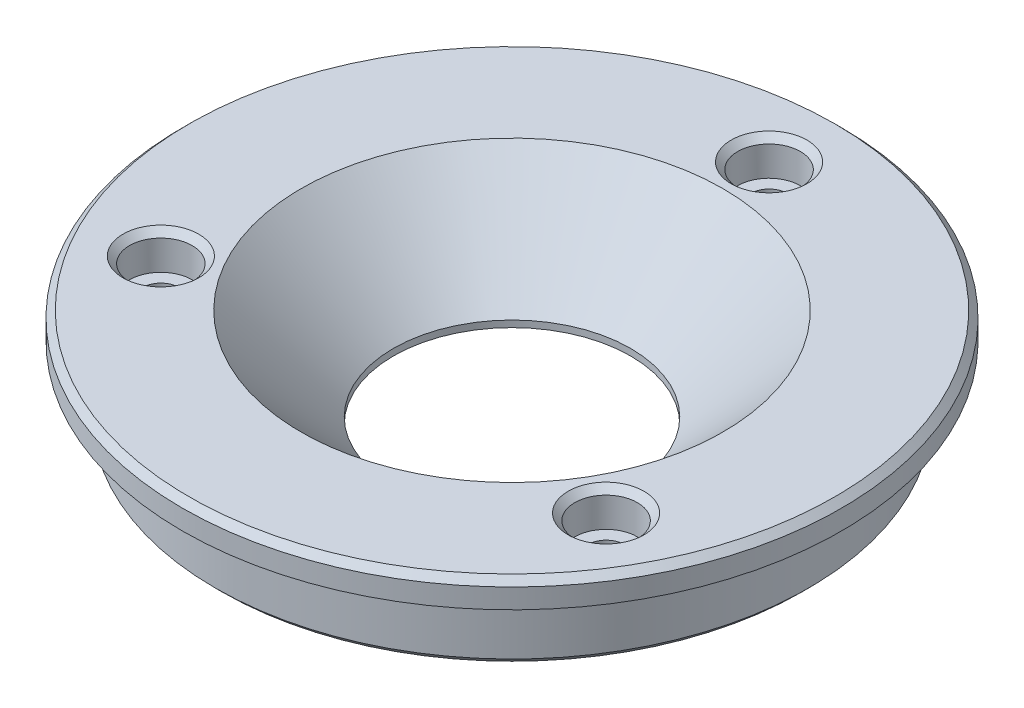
ISO-10303-21;
HEADER;
FILE_DESCRIPTION(('STEP AP214'),'2;1');
FILE_NAME('part.step','',(''),(''),'','','');
FILE_SCHEMA(('AUTOMOTIVE_DESIGN { 1 0 10303 214 1 1 1 1 }'));
ENDSEC;
DATA;
#1=APPLICATION_CONTEXT('core data for automotive mechanical design processes');
#2=APPLICATION_PROTOCOL_DEFINITION('international standard','automotive_design',2000,#1);
#3=PRODUCT_CONTEXT('',#1,'mechanical');
#4=PRODUCT('Part','Part','',(#3));
#5=PRODUCT_RELATED_PRODUCT_CATEGORY('part','',(#4));
#6=PRODUCT_DEFINITION_FORMATION('','',#4);
#7=PRODUCT_DEFINITION_CONTEXT('part definition',#1,'design');
#8=PRODUCT_DEFINITION('design','',#6,#7);
#9=PRODUCT_DEFINITION_SHAPE('','',#8);
#10=(LENGTH_UNIT() NAMED_UNIT(*) SI_UNIT(.MILLI.,.METRE.));
#11=(NAMED_UNIT(*) PLANE_ANGLE_UNIT() SI_UNIT($,.RADIAN.));
#12=(NAMED_UNIT(*) SI_UNIT($,.STERADIAN.) SOLID_ANGLE_UNIT());
#13=UNCERTAINTY_MEASURE_WITH_UNIT(LENGTH_MEASURE(1.E-05),#10,'distance_accuracy_value','');
#14=(GEOMETRIC_REPRESENTATION_CONTEXT(3) GLOBAL_UNCERTAINTY_ASSIGNED_CONTEXT((#13)) GLOBAL_UNIT_ASSIGNED_CONTEXT((#10,
#11,#12)) REPRESENTATION_CONTEXT('',''));
#15=CARTESIAN_POINT('',(0.,0.,0.));
#16=DIRECTION('',(0.,0.,1.));
#17=DIRECTION('',(1.,0.,0.));
#18=AXIS2_PLACEMENT_3D('',#15,#16,#17);
#19=CARTESIAN_POINT('',(-32.,15.,0.));
#20=DIRECTION('',(0.,-1.,0.));
#21=DIRECTION('',(0.,0.,-1.));
#22=AXIS2_PLACEMENT_3D('',#19,#20,#21);
#23=PLANE('',#22);
#24=CARTESIAN_POINT('',(33.7749907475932,15.,19.5));
#25=DIRECTION('',(0.,-1.,0.));
#26=DIRECTION('',(0.,0.,-1.));
#27=AXIS2_PLACEMENT_3D('',#24,#25,#26);
#28=CIRCLE('',#27,5.75);
#29=CARTESIAN_POINT('',(33.7749907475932,15.,13.75));
#30=VERTEX_POINT('',#29);
#31=EDGE_CURVE('E25',#30,#30,#28,.T.);
#32=ORIENTED_EDGE('',*,*,#31,.T.);
#33=EDGE_LOOP('',(#32));
#34=FACE_BOUND('',#33,.T.);
#35=CARTESIAN_POINT('',(0.,15.,-39.));
#36=DIRECTION('',(0.,-1.,0.));
#37=DIRECTION('',(0.,0.,-1.));
#38=AXIS2_PLACEMENT_3D('',#35,#36,#37);
#39=CIRCLE('',#38,5.75);
#40=CARTESIAN_POINT('',(0.,15.,-44.75));
#41=VERTEX_POINT('',#40);
#42=EDGE_CURVE('E29',#41,#41,#39,.T.);
#43=ORIENTED_EDGE('',*,*,#42,.T.);
#44=EDGE_LOOP('',(#43));
#45=FACE_BOUND('',#44,.T.);
#46=CARTESIAN_POINT('',(-33.7749907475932,15.,19.5));
#47=DIRECTION('',(0.,-1.,0.));
#48=DIRECTION('',(0.,0.,-1.));
#49=AXIS2_PLACEMENT_3D('',#46,#47,#48);
#50=CIRCLE('',#49,5.75);
#51=CARTESIAN_POINT('',(-33.7749907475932,15.,13.75));
#52=VERTEX_POINT('',#51);
#53=EDGE_CURVE('E34',#52,#52,#50,.T.);
#54=ORIENTED_EDGE('',*,*,#53,.T.);
#55=EDGE_LOOP('',(#54));
#56=FACE_BOUND('',#55,.T.);
#57=CARTESIAN_POINT('',(0.,15.,0.));
#58=DIRECTION('',(0.,-1.,0.));
#59=DIRECTION('',(0.,0.,-1.));
#60=AXIS2_PLACEMENT_3D('',#57,#58,#59);
#61=CIRCLE('',#60,49.);
#62=CARTESIAN_POINT('',(0.,15.,-49.));
#63=VERTEX_POINT('',#62);
#64=EDGE_CURVE('E58',#63,#63,#61,.F.);
#65=ORIENTED_EDGE('',*,*,#64,.T.);
#66=EDGE_LOOP('',(#65));
#67=FACE_BOUND('',#66,.T.);
#68=CARTESIAN_POINT('',(0.,15.,0.));
#69=DIRECTION('',(0.,-1.,0.));
#70=DIRECTION('',(0.,0.,-1.));
#71=AXIS2_PLACEMENT_3D('',#68,#69,#70);
#72=CIRCLE('',#71,32.);
#73=CARTESIAN_POINT('',(0.,15.,-32.));
#74=VERTEX_POINT('',#73);
#75=EDGE_CURVE('E70',#74,#74,#72,.T.);
#76=ORIENTED_EDGE('',*,*,#75,.T.);
#77=EDGE_LOOP('',(#76));
#78=FACE_BOUND('',#77,.T.);
#79=ADVANCED_FACE('F14',(#34,#45,#56,#67,#78),#23,.F.);
#80=CARTESIAN_POINT('',(0.,1.,0.));
#81=DIRECTION('',(0.,1.,0.));
#82=DIRECTION('',(0.,0.,1.));
#83=AXIS2_PLACEMENT_3D('',#80,#81,#82);
#84=CONICAL_SURFACE('',#83,18.,0.78539816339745);
#85=ORIENTED_EDGE('',*,*,#75,.F.);
#86=EDGE_LOOP('',(#85));
#87=FACE_BOUND('',#86,.T.);
#88=CARTESIAN_POINT('',(0.,1.,0.));
#89=DIRECTION('',(0.,-1.,0.));
#90=DIRECTION('',(0.,0.,-1.));
#91=AXIS2_PLACEMENT_3D('',#88,#89,#90);
#92=CIRCLE('',#91,18.);
#93=CARTESIAN_POINT('',(0.,1.,-18.));
#94=VERTEX_POINT('',#93);
#95=EDGE_CURVE('E83',#94,#94,#92,.T.);
#96=ORIENTED_EDGE('',*,*,#95,.T.);
#97=EDGE_LOOP('',(#96));
#98=FACE_BOUND('',#97,.T.);
#99=ADVANCED_FACE('F123',(#87,#98),#84,.F.);
#100=CARTESIAN_POINT('',(0.,0.,0.));
#101=DIRECTION('',(0.,-1.,0.));
#102=DIRECTION('',(0.,0.,-1.));
#103=AXIS2_PLACEMENT_3D('',#100,#101,#102);
#104=CYLINDRICAL_SURFACE('',#103,18.);
#105=ORIENTED_EDGE('',*,*,#95,.F.);
#106=EDGE_LOOP('',(#105));
#107=FACE_BOUND('',#106,.T.);
#108=CARTESIAN_POINT('',(0.,0.,0.));
#109=DIRECTION('',(0.,-1.,0.));
#110=DIRECTION('',(0.,0.,-1.));
#111=AXIS2_PLACEMENT_3D('',#108,#109,#110);
#112=CIRCLE('',#111,18.);
#113=CARTESIAN_POINT('',(0.,0.,-18.));
#114=VERTEX_POINT('',#113);
#115=EDGE_CURVE('E86',#114,#114,#112,.T.);
#116=ORIENTED_EDGE('',*,*,#115,.T.);
#117=EDGE_LOOP('',(#116));
#118=FACE_BOUND('',#117,.T.);
#119=ADVANCED_FACE('F130',(#107,#118),#104,.F.);
#120=CARTESIAN_POINT('',(-18.,0.,0.));
#121=DIRECTION('',(0.,1.,0.));
#122=DIRECTION('',(0.,0.,1.));
#123=AXIS2_PLACEMENT_3D('',#120,#121,#122);
#124=PLANE('',#123);
#125=CARTESIAN_POINT('',(-33.7749907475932,0.,19.5));
#126=DIRECTION('',(0.,1.,0.));
#127=DIRECTION('',(0.,0.,1.));
#128=AXIS2_PLACEMENT_3D('',#125,#126,#127);
#129=CIRCLE('',#128,3.74999999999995);
#130=CARTESIAN_POINT('',(-33.7749907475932,0.,23.25));
#131=VERTEX_POINT('',#130);
#132=EDGE_CURVE('E49',#131,#131,#129,.T.);
#133=ORIENTED_EDGE('',*,*,#132,.T.);
#134=EDGE_LOOP('',(#133));
#135=FACE_BOUND('',#134,.T.);
#136=CARTESIAN_POINT('',(33.7749907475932,0.,19.5));
#137=DIRECTION('',(0.,1.,0.));
#138=DIRECTION('',(0.,0.,1.));
#139=AXIS2_PLACEMENT_3D('',#136,#137,#138);
#140=CIRCLE('',#139,3.74999999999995);
#141=CARTESIAN_POINT('',(33.7749907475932,0.,23.25));
#142=VERTEX_POINT('',#141);
#143=EDGE_CURVE('E52',#142,#142,#140,.T.);
#144=ORIENTED_EDGE('',*,*,#143,.T.);
#145=EDGE_LOOP('',(#144));
#146=FACE_BOUND('',#145,.T.);
#147=CARTESIAN_POINT('',(0.,0.,-39.));
#148=DIRECTION('',(0.,1.,0.));
#149=DIRECTION('',(0.,0.,1.));
#150=AXIS2_PLACEMENT_3D('',#147,#148,#149);
#151=CIRCLE('',#150,3.75);
#152=CARTESIAN_POINT('',(0.,0.,-35.25));
#153=VERTEX_POINT('',#152);
#154=EDGE_CURVE('E55',#153,#153,#151,.T.);
#155=ORIENTED_EDGE('',*,*,#154,.T.);
#156=EDGE_LOOP('',(#155));
#157=FACE_BOUND('',#156,.T.);
#158=CARTESIAN_POINT('',(0.,0.,0.));
#159=DIRECTION('',(0.,1.,0.));
#160=DIRECTION('',(0.,0.,1.));
#161=AXIS2_PLACEMENT_3D('',#158,#159,#160);
#162=CIRCLE('',#161,44.);
#163=CARTESIAN_POINT('',(0.,0.,44.));
#164=VERTEX_POINT('',#163);
#165=EDGE_CURVE('E67',#164,#164,#162,.F.);
#166=ORIENTED_EDGE('',*,*,#165,.T.);
#167=EDGE_LOOP('',(#166));
#168=FACE_BOUND('',#167,.T.);
#169=ORIENTED_EDGE('',*,*,#115,.F.);
#170=EDGE_LOOP('',(#169));
#171=FACE_BOUND('',#170,.T.);
#172=ADVANCED_FACE('F181',(#135,#146,#157,#168,#171),#124,.F.);
#173=CARTESIAN_POINT('',(0.,0.,0.));
#174=DIRECTION('',(0.,-1.,0.));
#175=DIRECTION('',(0.,0.,-1.));
#176=AXIS2_PLACEMENT_3D('',#173,#174,#175);
#177=CYLINDRICAL_SURFACE('',#176,45.);
#178=CARTESIAN_POINT('',(0.,0.999999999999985,0.));
#179=DIRECTION('',(0.,1.,0.));
#180=DIRECTION('',(0.,0.,1.));
#181=AXIS2_PLACEMENT_3D('',#178,#179,#180);
#182=CIRCLE('',#181,45.);
#183=CARTESIAN_POINT('',(0.,0.999999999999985,45.));
#184=VERTEX_POINT('',#183);
#185=EDGE_CURVE('E64',#184,#184,#182,.T.);
#186=ORIENTED_EDGE('',*,*,#185,.T.);
#187=EDGE_LOOP('',(#186));
#188=FACE_BOUND('',#187,.T.);
#189=CARTESIAN_POINT('',(0.,11.,0.));
#190=DIRECTION('',(0.,-1.,0.));
#191=DIRECTION('',(0.,0.,-1.));
#192=AXIS2_PLACEMENT_3D('',#189,#190,#191);
#193=CIRCLE('',#192,45.);
#194=CARTESIAN_POINT('',(0.,11.,-45.));
#195=VERTEX_POINT('',#194);
#196=EDGE_CURVE('E89',#195,#195,#193,.T.);
#197=ORIENTED_EDGE('',*,*,#196,.T.);
#198=EDGE_LOOP('',(#197));
#199=FACE_BOUND('',#198,.T.);
#200=ADVANCED_FACE('F185',(#188,#199),#177,.T.);
#201=CARTESIAN_POINT('',(-45.,11.,0.));
#202=DIRECTION('',(0.,1.,0.));
#203=DIRECTION('',(0.,0.,1.));
#204=AXIS2_PLACEMENT_3D('',#201,#202,#203);
#205=PLANE('',#204);
#206=ORIENTED_EDGE('',*,*,#196,.F.);
#207=EDGE_LOOP('',(#206));
#208=FACE_BOUND('',#207,.T.);
#209=CARTESIAN_POINT('',(0.,11.,0.));
#210=DIRECTION('',(0.,-1.,0.));
#211=DIRECTION('',(0.,0.,-1.));
#212=AXIS2_PLACEMENT_3D('',#209,#210,#211);
#213=CIRCLE('',#212,50.);
#214=CARTESIAN_POINT('',(0.,11.,-50.));
#215=VERTEX_POINT('',#214);
#216=EDGE_CURVE('E92',#215,#215,#213,.T.);
#217=ORIENTED_EDGE('',*,*,#216,.T.);
#218=EDGE_LOOP('',(#217));
#219=FACE_BOUND('',#218,.T.);
#220=ADVANCED_FACE('F192',(#208,#219),#205,.F.);
#221=CARTESIAN_POINT('',(0.,0.,0.));
#222=DIRECTION('',(0.,-1.,0.));
#223=DIRECTION('',(0.,0.,-1.));
#224=AXIS2_PLACEMENT_3D('',#221,#222,#223);
#225=CYLINDRICAL_SURFACE('',#224,50.);
#226=CARTESIAN_POINT('',(0.,14.,0.));
#227=DIRECTION('',(0.,-1.,0.));
#228=DIRECTION('',(0.,0.,-1.));
#229=AXIS2_PLACEMENT_3D('',#226,#227,#228);
#230=CIRCLE('',#229,50.);
#231=CARTESIAN_POINT('',(0.,14.,-50.));
#232=VERTEX_POINT('',#231);
#233=EDGE_CURVE('E61',#232,#232,#230,.T.);
#234=ORIENTED_EDGE('',*,*,#233,.T.);
#235=EDGE_LOOP('',(#234));
#236=FACE_BOUND('',#235,.T.);
#237=ORIENTED_EDGE('',*,*,#216,.F.);
#238=EDGE_LOOP('',(#237));
#239=FACE_BOUND('',#238,.T.);
#240=ADVANCED_FACE('F199',(#236,#239),#225,.T.);
#241=CARTESIAN_POINT('',(33.7749907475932,9.5,19.5));
#242=DIRECTION('',(0.,1.,0.));
#243=DIRECTION('',(0.,0.,1.));
#244=AXIS2_PLACEMENT_3D('',#241,#242,#243);
#245=CYLINDRICAL_SURFACE('',#244,4.75);
#246=CARTESIAN_POINT('',(33.7749907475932,14.,19.5));
#247=DIRECTION('',(0.,-1.,0.));
#248=DIRECTION('',(0.,0.,-1.));
#249=AXIS2_PLACEMENT_3D('',#246,#247,#248);
#250=CIRCLE('',#249,4.75);
#251=CARTESIAN_POINT('',(33.7749907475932,14.,14.75));
#252=VERTEX_POINT('',#251);
#253=EDGE_CURVE('E37',#252,#252,#250,.F.);
#254=ORIENTED_EDGE('',*,*,#253,.T.);
#255=EDGE_LOOP('',(#254));
#256=FACE_BOUND('',#255,.T.);
#257=CARTESIAN_POINT('',(33.7749907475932,9.5,19.5));
#258=DIRECTION('',(0.,1.,0.));
#259=DIRECTION('',(0.,0.,-1.));
#260=AXIS2_PLACEMENT_3D('',#257,#258,#259);
#261=CIRCLE('',#260,4.75);
#262=CARTESIAN_POINT('',(33.7749907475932,9.5,14.75));
#263=VERTEX_POINT('',#262);
#264=EDGE_CURVE('E74',#263,#263,#261,.T.);
#265=ORIENTED_EDGE('',*,*,#264,.F.);
#266=EDGE_LOOP('',(#265));
#267=FACE_BOUND('',#266,.T.);
#268=ADVANCED_FACE('F203',(#256,#267),#245,.F.);
#269=CARTESIAN_POINT('',(33.7749907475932,9.5,19.5));
#270=DIRECTION('',(0.,-1.,0.));
#271=DIRECTION('',(0.,0.,-1.));
#272=AXIS2_PLACEMENT_3D('',#269,#270,#271);
#273=PLANE('',#272);
#274=CARTESIAN_POINT('',(33.7749907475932,9.5,19.5));
#275=DIRECTION('',(0.,-1.,0.));
#276=DIRECTION('',(0.,0.,-1.));
#277=AXIS2_PLACEMENT_3D('',#274,#275,#276);
#278=CIRCLE('',#277,2.75);
#279=CARTESIAN_POINT('',(33.7749907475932,9.5,16.75));
#280=VERTEX_POINT('',#279);
#281=EDGE_CURVE('E71',#280,#280,#278,.T.);
#282=ORIENTED_EDGE('',*,*,#281,.T.);
#283=EDGE_LOOP('',(#282));
#284=FACE_BOUND('',#283,.T.);
#285=ORIENTED_EDGE('',*,*,#264,.T.);
#286=EDGE_LOOP('',(#285));
#287=FACE_BOUND('',#286,.T.);
#288=ADVANCED_FACE('F207',(#284,#287),#273,.F.);
#289=CARTESIAN_POINT('',(-33.7749907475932,9.5,19.5));
#290=DIRECTION('',(0.,1.,0.));
#291=DIRECTION('',(0.,0.,1.));
#292=AXIS2_PLACEMENT_3D('',#289,#290,#291);
#293=CYLINDRICAL_SURFACE('',#292,4.75);
#294=CARTESIAN_POINT('',(-33.7749907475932,14.,19.5));
#295=DIRECTION('',(0.,-1.,0.));
#296=DIRECTION('',(0.,0.,-1.));
#297=AXIS2_PLACEMENT_3D('',#294,#295,#296);
#298=CIRCLE('',#297,4.75);
#299=CARTESIAN_POINT('',(-33.7749907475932,14.,14.75));
#300=VERTEX_POINT('',#299);
#301=EDGE_CURVE('E9',#300,#300,#298,.F.);
#302=ORIENTED_EDGE('',*,*,#301,.T.);
#303=EDGE_LOOP('',(#302));
#304=FACE_BOUND('',#303,.T.);
#305=CARTESIAN_POINT('',(-33.7749907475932,9.5,19.5));
#306=DIRECTION('',(0.,1.,0.));
#307=DIRECTION('',(0.,0.,1.));
#308=AXIS2_PLACEMENT_3D('',#305,#306,#307);
#309=CIRCLE('',#308,4.75);
#310=CARTESIAN_POINT('',(-33.7749907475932,9.5,24.25));
#311=VERTEX_POINT('',#310);
#312=EDGE_CURVE('E98',#311,#311,#309,.T.);
#313=ORIENTED_EDGE('',*,*,#312,.F.);
#314=EDGE_LOOP('',(#313));
#315=FACE_BOUND('',#314,.T.);
#316=ADVANCED_FACE('F119',(#304,#315),#293,.F.);
#317=CARTESIAN_POINT('',(-33.7749907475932,9.5,19.5));
#318=DIRECTION('',(0.,1.,0.));
#319=DIRECTION('',(0.,0.,1.));
#320=AXIS2_PLACEMENT_3D('',#317,#318,#319);
#321=PLANE('',#320);
#322=CARTESIAN_POINT('',(-33.7749907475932,9.5,19.5));
#323=DIRECTION('',(0.,1.,0.));
#324=DIRECTION('',(0.,0.,1.));
#325=AXIS2_PLACEMENT_3D('',#322,#323,#324);
#326=CIRCLE('',#325,2.75);
#327=CARTESIAN_POINT('',(-33.7749907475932,9.5,22.25));
#328=VERTEX_POINT('',#327);
#329=EDGE_CURVE('E75',#328,#328,#326,.T.);
#330=ORIENTED_EDGE('',*,*,#329,.F.);
#331=EDGE_LOOP('',(#330));
#332=FACE_BOUND('',#331,.T.);
#333=ORIENTED_EDGE('',*,*,#312,.T.);
#334=EDGE_LOOP('',(#333));
#335=FACE_BOUND('',#334,.T.);
#336=ADVANCED_FACE('F108',(#332,#335),#321,.T.);
#337=CARTESIAN_POINT('',(0.,9.5,-39.));
#338=DIRECTION('',(0.,1.,0.));
#339=DIRECTION('',(0.,0.,1.));
#340=AXIS2_PLACEMENT_3D('',#337,#338,#339);
#341=CYLINDRICAL_SURFACE('',#340,4.75);
#342=CARTESIAN_POINT('',(0.,14.,-39.));
#343=DIRECTION('',(0.,-1.,0.));
#344=DIRECTION('',(0.,0.,-1.));
#345=AXIS2_PLACEMENT_3D('',#342,#343,#344);
#346=CIRCLE('',#345,4.75);
#347=CARTESIAN_POINT('',(0.,14.,-43.75));
#348=VERTEX_POINT('',#347);
#349=EDGE_CURVE('E21',#348,#348,#346,.F.);
#350=ORIENTED_EDGE('',*,*,#349,.T.);
#351=EDGE_LOOP('',(#350));
#352=FACE_BOUND('',#351,.T.);
#353=CARTESIAN_POINT('',(0.,9.5,-39.));
#354=DIRECTION('',(0.,1.,0.));
#355=DIRECTION('',(0.,0.,1.));
#356=AXIS2_PLACEMENT_3D('',#353,#354,#355);
#357=CIRCLE('',#356,4.75);
#358=CARTESIAN_POINT('',(0.,9.5,-34.25));
#359=VERTEX_POINT('',#358);
#360=EDGE_CURVE('E95',#359,#359,#357,.T.);
#361=ORIENTED_EDGE('',*,*,#360,.F.);
#362=EDGE_LOOP('',(#361));
#363=FACE_BOUND('',#362,.T.);
#364=ADVANCED_FACE('F106',(#352,#363),#341,.F.);
#365=CARTESIAN_POINT('',(0.,9.5,-39.));
#366=DIRECTION('',(0.,1.,0.));
#367=DIRECTION('',(0.,0.,1.));
#368=AXIS2_PLACEMENT_3D('',#365,#366,#367);
#369=PLANE('',#368);
#370=CARTESIAN_POINT('',(0.,9.5,-39.));
#371=DIRECTION('',(0.,1.,0.));
#372=DIRECTION('',(0.,0.,1.));
#373=AXIS2_PLACEMENT_3D('',#370,#371,#372);
#374=CIRCLE('',#373,2.75);
#375=CARTESIAN_POINT('',(0.,9.5,-36.25));
#376=VERTEX_POINT('',#375);
#377=EDGE_CURVE('E78',#376,#376,#374,.T.);
#378=ORIENTED_EDGE('',*,*,#377,.F.);
#379=EDGE_LOOP('',(#378));
#380=FACE_BOUND('',#379,.T.);
#381=ORIENTED_EDGE('',*,*,#360,.T.);
#382=EDGE_LOOP('',(#381));
#383=FACE_BOUND('',#382,.T.);
#384=ADVANCED_FACE('F104',(#380,#383),#369,.T.);
#385=CARTESIAN_POINT('',(0.,0.,-39.));
#386=DIRECTION('',(0.,1.,0.));
#387=DIRECTION('',(0.,0.,1.));
#388=AXIS2_PLACEMENT_3D('',#385,#386,#387);
#389=CYLINDRICAL_SURFACE('',#388,2.75);
#390=CARTESIAN_POINT('',(0.,0.999999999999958,-39.));
#391=DIRECTION('',(0.,1.,0.));
#392=DIRECTION('',(0.,0.,1.));
#393=AXIS2_PLACEMENT_3D('',#390,#391,#392);
#394=CIRCLE('',#393,2.75);
#395=CARTESIAN_POINT('',(0.,0.999999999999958,-36.25));
#396=VERTEX_POINT('',#395);
#397=EDGE_CURVE('E40',#396,#396,#394,.F.);
#398=ORIENTED_EDGE('',*,*,#397,.T.);
#399=EDGE_LOOP('',(#398));
#400=FACE_BOUND('',#399,.T.);
#401=ORIENTED_EDGE('',*,*,#377,.T.);
#402=EDGE_LOOP('',(#401));
#403=FACE_BOUND('',#402,.T.);
#404=ADVANCED_FACE('F116',(#400,#403),#389,.F.);
#405=CARTESIAN_POINT('',(-33.7749907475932,0.,19.5));
#406=DIRECTION('',(0.,1.,0.));
#407=DIRECTION('',(0.,0.,1.));
#408=AXIS2_PLACEMENT_3D('',#405,#406,#407);
#409=CYLINDRICAL_SURFACE('',#408,2.75);
#410=CARTESIAN_POINT('',(-33.7749907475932,0.999999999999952,19.5));
#411=DIRECTION('',(0.,1.,0.));
#412=DIRECTION('',(0.,0.,1.));
#413=AXIS2_PLACEMENT_3D('',#410,#411,#412);
#414=CIRCLE('',#413,2.75);
#415=CARTESIAN_POINT('',(-33.7749907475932,0.999999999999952,22.25));
#416=VERTEX_POINT('',#415);
#417=EDGE_CURVE('E46',#416,#416,#414,.F.);
#418=ORIENTED_EDGE('',*,*,#417,.T.);
#419=EDGE_LOOP('',(#418));
#420=FACE_BOUND('',#419,.T.);
#421=ORIENTED_EDGE('',*,*,#329,.T.);
#422=EDGE_LOOP('',(#421));
#423=FACE_BOUND('',#422,.T.);
#424=ADVANCED_FACE('F338',(#420,#423),#409,.F.);
#425=CARTESIAN_POINT('',(33.7749907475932,0.,19.5));
#426=DIRECTION('',(0.,1.,0.));
#427=DIRECTION('',(0.,0.,1.));
#428=AXIS2_PLACEMENT_3D('',#425,#426,#427);
#429=CYLINDRICAL_SURFACE('',#428,2.75);
#430=CARTESIAN_POINT('',(33.7749907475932,0.999999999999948,19.5));
#431=DIRECTION('',(0.,1.,0.));
#432=DIRECTION('',(0.,0.,1.));
#433=AXIS2_PLACEMENT_3D('',#430,#431,#432);
#434=CIRCLE('',#433,2.75);
#435=CARTESIAN_POINT('',(33.7749907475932,0.999999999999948,22.25));
#436=VERTEX_POINT('',#435);
#437=EDGE_CURVE('E43',#436,#436,#434,.F.);
#438=ORIENTED_EDGE('',*,*,#437,.T.);
#439=EDGE_LOOP('',(#438));
#440=FACE_BOUND('',#439,.T.);
#441=ORIENTED_EDGE('',*,*,#281,.F.);
#442=EDGE_LOOP('',(#441));
#443=FACE_BOUND('',#442,.T.);
#444=ADVANCED_FACE('F140',(#440,#443),#429,.F.);
#445=CARTESIAN_POINT('',(0.,0.,0.));
#446=DIRECTION('',(0.,1.,0.));
#447=DIRECTION('',(0.,0.,1.));
#448=AXIS2_PLACEMENT_3D('',#445,#446,#447);
#449=CONICAL_SURFACE('',#448,44.,0.785398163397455);
#450=ORIENTED_EDGE('',*,*,#185,.F.);
#451=EDGE_LOOP('',(#450));
#452=FACE_BOUND('',#451,.T.);
#453=ORIENTED_EDGE('',*,*,#165,.F.);
#454=EDGE_LOOP('',(#453));
#455=FACE_BOUND('',#454,.T.);
#456=ADVANCED_FACE('F136',(#452,#455),#449,.T.);
#457=CARTESIAN_POINT('',(0.,14.,0.));
#458=DIRECTION('',(0.,-1.,0.));
#459=DIRECTION('',(0.,0.,-1.));
#460=AXIS2_PLACEMENT_3D('',#457,#458,#459);
#461=CONICAL_SURFACE('',#460,50.,0.785398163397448);
#462=ORIENTED_EDGE('',*,*,#64,.F.);
#463=EDGE_LOOP('',(#462));
#464=FACE_BOUND('',#463,.T.);
#465=ORIENTED_EDGE('',*,*,#233,.F.);
#466=EDGE_LOOP('',(#465));
#467=FACE_BOUND('',#466,.T.);
#468=ADVANCED_FACE('F139',(#464,#467),#461,.T.);
#469=CARTESIAN_POINT('',(-33.7749907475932,0.,19.5));
#470=DIRECTION('',(0.,-1.,0.));
#471=DIRECTION('',(0.,0.,-1.));
#472=AXIS2_PLACEMENT_3D('',#469,#470,#471);
#473=CONICAL_SURFACE('',#472,3.74999999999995,0.785398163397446);
#474=ORIENTED_EDGE('',*,*,#417,.F.);
#475=EDGE_LOOP('',(#474));
#476=FACE_BOUND('',#475,.T.);
#477=ORIENTED_EDGE('',*,*,#132,.F.);
#478=EDGE_LOOP('',(#477));
#479=FACE_BOUND('',#478,.T.);
#480=ADVANCED_FACE('F144',(#476,#479),#473,.F.);
#481=CARTESIAN_POINT('',(33.7749907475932,0.,19.5));
#482=DIRECTION('',(0.,-1.,0.));
#483=DIRECTION('',(0.,0.,-1.));
#484=AXIS2_PLACEMENT_3D('',#481,#482,#483);
#485=CONICAL_SURFACE('',#484,3.74999999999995,0.785398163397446);
#486=ORIENTED_EDGE('',*,*,#437,.F.);
#487=EDGE_LOOP('',(#486));
#488=FACE_BOUND('',#487,.T.);
#489=ORIENTED_EDGE('',*,*,#143,.F.);
#490=EDGE_LOOP('',(#489));
#491=FACE_BOUND('',#490,.T.);
#492=ADVANCED_FACE('F148',(#488,#491),#485,.F.);
#493=CARTESIAN_POINT('',(0.,0.,-39.));
#494=DIRECTION('',(0.,-1.,0.));
#495=DIRECTION('',(0.,0.,-1.));
#496=AXIS2_PLACEMENT_3D('',#493,#494,#495);
#497=CONICAL_SURFACE('',#496,3.75,0.785398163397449);
#498=ORIENTED_EDGE('',*,*,#397,.F.);
#499=EDGE_LOOP('',(#498));
#500=FACE_BOUND('',#499,.T.);
#501=ORIENTED_EDGE('',*,*,#154,.F.);
#502=EDGE_LOOP('',(#501));
#503=FACE_BOUND('',#502,.T.);
#504=ADVANCED_FACE('F152',(#500,#503),#497,.F.);
#505=CARTESIAN_POINT('',(33.7749907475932,14.,19.5));
#506=DIRECTION('',(0.,1.,0.));
#507=DIRECTION('',(0.,0.,1.));
#508=AXIS2_PLACEMENT_3D('',#505,#506,#507);
#509=CONICAL_SURFACE('',#508,4.75,0.785398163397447);
#510=ORIENTED_EDGE('',*,*,#31,.F.);
#511=EDGE_LOOP('',(#510));
#512=FACE_BOUND('',#511,.T.);
#513=ORIENTED_EDGE('',*,*,#253,.F.);
#514=EDGE_LOOP('',(#513));
#515=FACE_BOUND('',#514,.T.);
#516=ADVANCED_FACE('F156',(#512,#515),#509,.F.);
#517=CARTESIAN_POINT('',(0.,14.,-39.));
#518=DIRECTION('',(0.,1.,0.));
#519=DIRECTION('',(0.,0.,1.));
#520=AXIS2_PLACEMENT_3D('',#517,#518,#519);
#521=CONICAL_SURFACE('',#520,4.75,0.785398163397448);
#522=ORIENTED_EDGE('',*,*,#42,.F.);
#523=EDGE_LOOP('',(#522));
#524=FACE_BOUND('',#523,.T.);
#525=ORIENTED_EDGE('',*,*,#349,.F.);
#526=EDGE_LOOP('',(#525));
#527=FACE_BOUND('',#526,.T.);
#528=ADVANCED_FACE('F159',(#524,#527),#521,.F.);
#529=CARTESIAN_POINT('',(-33.7749907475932,14.,19.5));
#530=DIRECTION('',(0.,1.,0.));
#531=DIRECTION('',(0.,0.,1.));
#532=AXIS2_PLACEMENT_3D('',#529,#530,#531);
#533=CONICAL_SURFACE('',#532,4.75,0.785398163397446);
#534=ORIENTED_EDGE('',*,*,#53,.F.);
#535=EDGE_LOOP('',(#534));
#536=FACE_BOUND('',#535,.T.);
#537=ORIENTED_EDGE('',*,*,#301,.F.);
#538=EDGE_LOOP('',(#537));
#539=FACE_BOUND('',#538,.T.);
#540=ADVANCED_FACE('F16',(#536,#539),#533,.F.);
#541=CLOSED_SHELL('',(#79,#99,#119,#172,#200,#220,#240,#268,#288,#316,#336,#364,#384,#404,#424,
#444,#456,#468,#480,#492,#504,#516,#528,#540));
#542=MANIFOLD_SOLID_BREP('B1',#541);
#543=ADVANCED_BREP_SHAPE_REPRESENTATION('',(#18,#542),#14);
#544=SHAPE_DEFINITION_REPRESENTATION(#9,#543);
ENDSEC;
END-ISO-10303-21;
